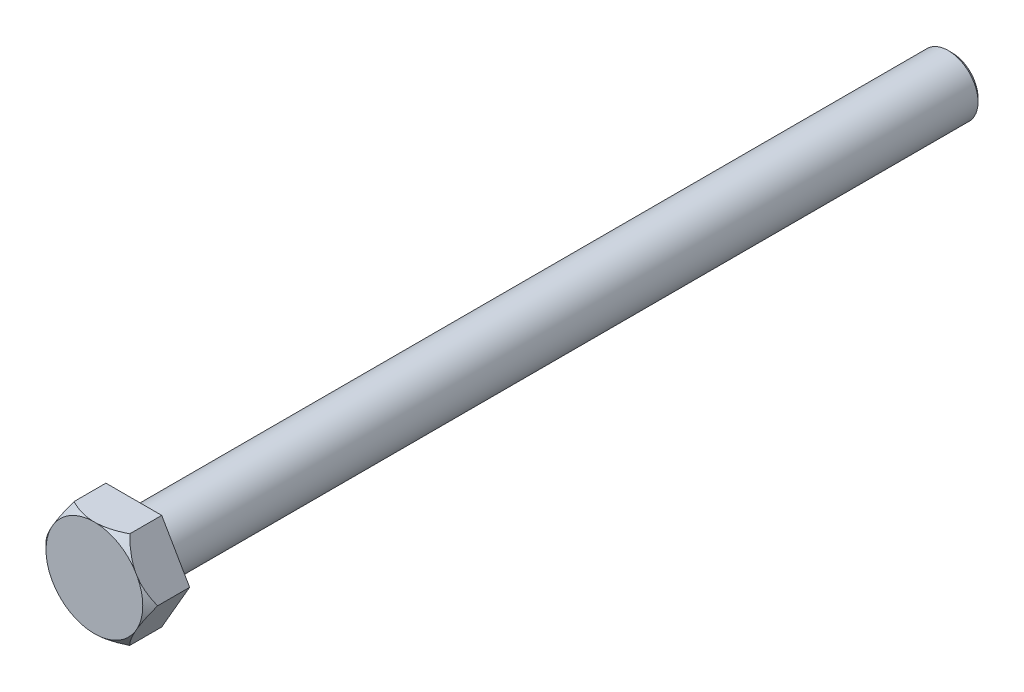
ISO-10303-21;
HEADER;
FILE_DESCRIPTION(('STEP AP214'),'2;1');
FILE_NAME('part.step','',(''),(''),'','','');
FILE_SCHEMA(('AUTOMOTIVE_DESIGN { 1 0 10303 214 1 1 1 1 }'));
ENDSEC;
DATA;
#1=APPLICATION_CONTEXT('core data for automotive mechanical design processes');
#2=APPLICATION_PROTOCOL_DEFINITION('international standard','automotive_design',2000,#1);
#3=PRODUCT_CONTEXT('',#1,'mechanical');
#4=PRODUCT('Part','Part','',(#3));
#5=PRODUCT_RELATED_PRODUCT_CATEGORY('part','',(#4));
#6=PRODUCT_DEFINITION_FORMATION('','',#4);
#7=PRODUCT_DEFINITION_CONTEXT('part definition',#1,'design');
#8=PRODUCT_DEFINITION('design','',#6,#7);
#9=PRODUCT_DEFINITION_SHAPE('','',#8);
#10=(LENGTH_UNIT() NAMED_UNIT(*) SI_UNIT(.MILLI.,.METRE.));
#11=(NAMED_UNIT(*) PLANE_ANGLE_UNIT() SI_UNIT($,.RADIAN.));
#12=(NAMED_UNIT(*) SI_UNIT($,.STERADIAN.) SOLID_ANGLE_UNIT());
#13=UNCERTAINTY_MEASURE_WITH_UNIT(LENGTH_MEASURE(1.E-05),#10,'distance_accuracy_value','');
#14=(GEOMETRIC_REPRESENTATION_CONTEXT(3) GLOBAL_UNCERTAINTY_ASSIGNED_CONTEXT((#13)) GLOBAL_UNIT_ASSIGNED_CONTEXT((#10,
#11,#12)) REPRESENTATION_CONTEXT('',''));
#15=CARTESIAN_POINT('',(0.,0.,0.));
#16=DIRECTION('',(0.,0.,1.));
#17=DIRECTION('',(1.,0.,0.));
#18=AXIS2_PLACEMENT_3D('',#15,#16,#17);
#19=CARTESIAN_POINT('',(0.,-4.,0.));
#20=DIRECTION('',(0.,0.,1.));
#21=DIRECTION('',(1.,0.,0.));
#22=AXIS2_PLACEMENT_3D('',#19,#20,#21);
#23=PLANE('',#22);
#24=CARTESIAN_POINT('',(0.,0.,0.));
#25=DIRECTION('',(0.,0.,1.));
#26=DIRECTION('',(1.,0.,0.));
#27=AXIS2_PLACEMENT_3D('',#24,#25,#26);
#28=CIRCLE('',#27,4.);
#29=CARTESIAN_POINT('',(4.,0.,0.));
#30=VERTEX_POINT('',#29);
#31=EDGE_CURVE('E11',#30,#30,#28,.T.);
#32=ORIENTED_EDGE('',*,*,#31,.T.);
#33=EDGE_LOOP('',(#32));
#34=FACE_BOUND('',#33,.T.);
#35=ADVANCED_FACE('F38',(#34),#23,.T.);
#36=CARTESIAN_POINT('',(0.,0.,0.));
#37=DIRECTION('',(0.,0.,1.));
#38=DIRECTION('',(1.,0.,0.));
#39=AXIS2_PLACEMENT_3D('',#36,#37,#38);
#40=CYLINDRICAL_SURFACE('',#39,4.);
#41=CARTESIAN_POINT('',(0.,0.,-109.5));
#42=DIRECTION('',(0.,0.,1.));
#43=DIRECTION('',(1.,0.,0.));
#44=AXIS2_PLACEMENT_3D('',#41,#42,#43);
#45=CIRCLE('',#44,4.);
#46=CARTESIAN_POINT('',(4.,0.,-109.5));
#47=VERTEX_POINT('',#46);
#48=EDGE_CURVE('E44',#47,#47,#45,.T.);
#49=ORIENTED_EDGE('',*,*,#48,.T.);
#50=EDGE_LOOP('',(#49));
#51=FACE_BOUND('',#50,.T.);
#52=ORIENTED_EDGE('',*,*,#31,.F.);
#53=EDGE_LOOP('',(#52));
#54=FACE_BOUND('',#53,.T.);
#55=ADVANCED_FACE('F64',(#51,#54),#40,.T.);
#56=CARTESIAN_POINT('',(0.,0.,-109.5));
#57=DIRECTION('',(0.,0.,1.));
#58=DIRECTION('',(1.,0.,0.));
#59=AXIS2_PLACEMENT_3D('',#56,#57,#58);
#60=CONICAL_SURFACE('',#59,4.,0.785398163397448);
#61=CARTESIAN_POINT('',(0.,0.,-110.));
#62=DIRECTION('',(0.,0.,1.));
#63=DIRECTION('',(1.,0.,0.));
#64=AXIS2_PLACEMENT_3D('',#61,#62,#63);
#65=CIRCLE('',#64,3.5);
#66=CARTESIAN_POINT('',(3.5,0.,-110.));
#67=VERTEX_POINT('',#66);
#68=EDGE_CURVE('E48',#67,#67,#65,.T.);
#69=ORIENTED_EDGE('',*,*,#68,.T.);
#70=EDGE_LOOP('',(#69));
#71=FACE_BOUND('',#70,.T.);
#72=ORIENTED_EDGE('',*,*,#48,.F.);
#73=EDGE_LOOP('',(#72));
#74=FACE_BOUND('',#73,.T.);
#75=ADVANCED_FACE('F55',(#71,#74),#60,.T.);
#76=CARTESIAN_POINT('',(0.,-3.5,-110.));
#77=DIRECTION('',(0.,0.,-1.));
#78=DIRECTION('',(-1.,0.,0.));
#79=AXIS2_PLACEMENT_3D('',#76,#77,#78);
#80=PLANE('',#79);
#81=ORIENTED_EDGE('',*,*,#68,.F.);
#82=EDGE_LOOP('',(#81));
#83=FACE_BOUND('',#82,.T.);
#84=ADVANCED_FACE('F58',(#83),#80,.T.);
#85=CLOSED_SHELL('',(#35,#55,#75,#84));
#86=MANIFOLD_SOLID_BREP('B2',#85);
#87=CARTESIAN_POINT('',(3.75277674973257,-6.5,5.3));
#88=DIRECTION('',(-0.866025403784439,0.5,0.));
#89=DIRECTION('',(-0.5,-0.866025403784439,0.));
#90=AXIS2_PLACEMENT_3D('',#87,#88,#89);
#91=PLANE('',#90);
#92=DIRECTION('',(0.,0.,-1.));
#93=VECTOR('',#92,1.);
#94=CARTESIAN_POINT('',(7.50555349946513,0.,5.3));
#95=LINE('',#94,#93);
#96=CARTESIAN_POINT('',(7.50555349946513,0.,4.3));
#97=VERTEX_POINT('',#96);
#98=CARTESIAN_POINT('',(7.50555349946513,0.,0.));
#99=VERTEX_POINT('',#98);
#100=EDGE_CURVE('E240',#97,#99,#95,.T.);
#101=ORIENTED_EDGE('',*,*,#100,.F.);
#102=CARTESIAN_POINT('',(10.1286443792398,4.54332667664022,0.704596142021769));
#103=CARTESIAN_POINT('',(10.039761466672,4.38937695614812,0.848684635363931));
#104=CARTESIAN_POINT('',(9.95052655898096,4.23481756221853,0.991912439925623));
#105=CARTESIAN_POINT('',(9.77123095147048,3.92426846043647,1.27631743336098));
#106=CARTESIAN_POINT('',(9.68117017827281,3.76827862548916,1.41749443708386));
#107=CARTESIAN_POINT('',(9.49990390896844,3.45431623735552,1.69777201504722));
#108=CARTESIAN_POINT('',(9.40869621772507,3.29633988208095,1.83686692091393));
#109=CARTESIAN_POINT('',(9.2252068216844,2.97852692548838,2.11218789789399));
#110=CARTESIAN_POINT('',(9.13292514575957,2.81869037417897,2.24841404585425));
#111=CARTESIAN_POINT('',(8.94456358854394,2.49243858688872,2.52115169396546));
#112=CARTESIAN_POINT('',(8.84844908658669,2.32596338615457,2.65756778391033));
#113=CARTESIAN_POINT('',(8.65470525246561,1.99038922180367,2.92602381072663));
#114=CARTESIAN_POINT('',(8.5570759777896,1.82129035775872,3.0580639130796));
#115=CARTESIAN_POINT('',(8.36013893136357,1.48018538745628,3.31668899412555));
#116=CARTESIAN_POINT('',(8.26083264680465,1.30818185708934,3.44327848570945));
#117=CARTESIAN_POINT('',(8.0601982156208,0.960672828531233,3.68985078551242));
#118=CARTESIAN_POINT('',(7.95887032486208,0.78516777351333,3.80983442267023));
#119=CARTESIAN_POINT('',(7.75111491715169,0.425324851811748,4.04472132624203));
#120=CARTESIAN_POINT('',(7.64462356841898,0.24087642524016,4.15940026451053));
#121=CARTESIAN_POINT('',(7.42883796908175,-0.132875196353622,4.37785828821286));
#122=CARTESIAN_POINT('',(7.31954332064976,-0.3221790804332,4.48163581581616));
#123=CARTESIAN_POINT('',(7.09850568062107,-0.705027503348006,4.67487713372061));
#124=CARTESIAN_POINT('',(6.98677906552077,-0.898543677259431,4.7644150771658));
#125=CARTESIAN_POINT('',(6.76025349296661,-1.29089747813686,4.92639894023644));
#126=CARTESIAN_POINT('',(6.64545547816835,-1.48973347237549,4.99885003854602));
#127=CARTESIAN_POINT('',(6.43587432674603,-1.85273867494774,5.11072478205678));
#128=CARTESIAN_POINT('',(6.34158660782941,-2.01604979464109,5.15384004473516));
#129=CARTESIAN_POINT('',(6.15157362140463,-2.34516194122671,5.22476075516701));
#130=CARTESIAN_POINT('',(6.0558485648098,-2.51096260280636,5.25256842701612));
#131=CARTESIAN_POINT('',(5.8637126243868,-2.84375181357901,5.29144611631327));
#132=CARTESIAN_POINT('',(5.76730326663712,-3.01073771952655,5.30254587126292));
#133=CARTESIAN_POINT('',(5.5743709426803,-3.34490630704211,5.30749252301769));
#134=CARTESIAN_POINT('',(5.47784797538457,-3.51208899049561,5.30133925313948));
#135=CARTESIAN_POINT('',(5.28569658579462,-3.84490496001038,5.27215863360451));
#136=CARTESIAN_POINT('',(5.19006652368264,-4.01054108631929,5.24917378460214));
#137=CARTESIAN_POINT('',(5.00008490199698,-4.33959890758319,5.18756324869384));
#138=CARTESIAN_POINT('',(4.90573344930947,-4.50302041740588,5.14893626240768));
#139=CARTESIAN_POINT('',(4.71846263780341,-4.82738297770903,5.05763503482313));
#140=CARTESIAN_POINT('',(4.6255484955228,-4.98831499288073,5.00491850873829));
#141=CARTESIAN_POINT('',(4.44167070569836,-5.30680066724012,4.88744691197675));
#142=CARTESIAN_POINT('',(4.35070696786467,-5.46435448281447,4.82269239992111));
#143=CARTESIAN_POINT('',(4.13900239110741,-5.83103756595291,4.65838995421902));
#144=CARTESIAN_POINT('',(4.01908237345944,-6.03874512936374,4.55462806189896));
#145=CARTESIAN_POINT('',(3.78262258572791,-6.4483054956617,4.33258564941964));
#146=CARTESIAN_POINT('',(3.66608473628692,-6.65015497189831,4.21429707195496));
#147=CARTESIAN_POINT('',(3.43582542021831,-7.0489758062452,3.96621331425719));
#148=CARTESIAN_POINT('',(3.3221102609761,-7.2459362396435,3.83639489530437));
#149=CARTESIAN_POINT('',(3.09735084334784,-7.63523097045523,3.56796602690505));
#150=CARTESIAN_POINT('',(2.98630610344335,-7.82756610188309,3.4293571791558));
#151=CARTESIAN_POINT('',(2.76596059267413,-8.20921572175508,3.14452754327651));
#152=CARTESIAN_POINT('',(2.65667036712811,-8.39851194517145,2.99827427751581));
#153=CARTESIAN_POINT('',(2.44001623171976,-8.77376791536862,2.70017211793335));
#154=CARTESIAN_POINT('',(2.33265239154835,-8.95972754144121,2.54832302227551));
#155=CARTESIAN_POINT('',(2.11967159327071,-9.32862110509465,2.24027391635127));
#156=CARTESIAN_POINT('',(2.01405293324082,-9.51155799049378,2.08407859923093));
#157=CARTESIAN_POINT('',(1.80420589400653,-9.87502372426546,1.76801397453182));
#158=CARTESIAN_POINT('',(1.69997748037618,-10.0555526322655,1.60814475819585));
#159=CARTESIAN_POINT('',(1.51776278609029,-10.3711577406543,1.32438976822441));
#160=CARTESIAN_POINT('',(1.43952456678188,-10.5066703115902,1.20114938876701));
#161=CARTESIAN_POINT('',(1.28399947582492,-10.7760476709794,0.953684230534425));
#162=CARTESIAN_POINT('',(1.20670993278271,-10.9099170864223,0.829466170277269));
#163=CARTESIAN_POINT('',(1.12968586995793,-11.0433266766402,0.704596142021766));
#164=B_SPLINE_CURVE_WITH_KNOTS('',3,(#102,#103,#104,#105,#106,#107,#108,#109,#110,#111,#112,
#113,#114,#115,#116,#117,#118,#119,#120,#121,#122,#123,#124,#125,#126,#127,#128,#129,#130,#131,
#132,#133,#134,#135,#136,#137,#138,#139,#140,#141,#142,#143,#144,#145,#146,#147,#148,#149,#150,
#151,#152,#153,#154,#155,#156,#157,#158,#159,#160,#161,#162,#163),.UNSPECIFIED.,.F.,.F.,(4,2,2,
2,2,2,2,2,2,2,2,2,2,2,2,2,2,2,2,2,2,2,2,2,2,2,2,2,2,2,4),(0.,0.686488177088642,1.3730379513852,
2.06120340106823,2.749350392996,3.4564439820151,4.16351080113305,4.8699804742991,
5.57636129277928,6.30179544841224,7.02733312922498,7.74895922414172,8.47036632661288,
9.05013970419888,9.62982882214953,10.2084849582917,10.7871466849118,11.3643522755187,
11.941605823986,12.52061163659,13.0995905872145,13.8829026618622,14.6666511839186,
15.4520168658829,16.2372398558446,17.0261239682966,17.8150365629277,18.6031280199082,
19.3911999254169,19.9887336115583,20.5836377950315),.UNSPECIFIED.);
#165=CARTESIAN_POINT('',(5.76353991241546,-3.01725604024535,5.3));
#166=VERTEX_POINT('',#165);
#167=EDGE_CURVE('E218',#97,#166,#164,.T.);
#168=ORIENTED_EDGE('',*,*,#167,.T.);
#169=DIRECTION('',(0.5,0.866025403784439,0.));
#170=VECTOR('',#169,1.);
#171=CARTESIAN_POINT('',(3.75277674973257,-6.5,5.3));
#172=LINE('',#171,#170);
#173=CARTESIAN_POINT('',(5.49479033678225,-3.48274395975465,5.3));
#174=VERTEX_POINT('',#173);
#175=EDGE_CURVE('E232',#174,#166,#172,.T.);
#176=ORIENTED_EDGE('',*,*,#175,.F.);
#177=CARTESIAN_POINT('',(3.75277674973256,-6.5,4.3));
#178=VERTEX_POINT('',#177);
#179=EDGE_CURVE('E305',#174,#178,#164,.T.);
#180=ORIENTED_EDGE('',*,*,#179,.T.);
#181=DIRECTION('',(0.,0.,-1.));
#182=VECTOR('',#181,1.);
#183=CARTESIAN_POINT('',(3.75277674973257,-6.5,5.3));
#184=LINE('',#183,#182);
#185=CARTESIAN_POINT('',(3.75277674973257,-6.5,0.));
#186=VERTEX_POINT('',#185);
#187=EDGE_CURVE('E213',#178,#186,#184,.T.);
#188=ORIENTED_EDGE('',*,*,#187,.T.);
#189=DIRECTION('',(0.5,0.866025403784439,0.));
#190=VECTOR('',#189,1.);
#191=CARTESIAN_POINT('',(3.75277674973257,-6.5,0.));
#192=LINE('',#191,#190);
#193=EDGE_CURVE('E214',#186,#99,#192,.T.);
#194=ORIENTED_EDGE('',*,*,#193,.T.);
#195=EDGE_LOOP('',(#101,#168,#176,#180,#188,#194));
#196=FACE_BOUND('',#195,.T.);
#197=ADVANCED_FACE('F93',(#196),#91,.F.);
#198=CARTESIAN_POINT('',(7.50555349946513,0.,5.3));
#199=DIRECTION('',(-0.866025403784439,-0.5,0.));
#200=DIRECTION('',(0.5,-0.866025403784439,0.));
#201=AXIS2_PLACEMENT_3D('',#198,#199,#200);
#202=PLANE('',#201);
#203=DIRECTION('',(0.,0.,-1.));
#204=VECTOR('',#203,1.);
#205=CARTESIAN_POINT('',(3.75277674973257,6.5,5.3));
#206=LINE('',#205,#204);
#207=CARTESIAN_POINT('',(3.75277674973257,6.5,4.3));
#208=VERTEX_POINT('',#207);
#209=CARTESIAN_POINT('',(3.75277674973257,6.5,0.));
#210=VERTEX_POINT('',#209);
#211=EDGE_CURVE('E239',#208,#210,#206,.T.);
#212=ORIENTED_EDGE('',*,*,#211,.F.);
#213=CARTESIAN_POINT('',(1.12968586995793,11.0433266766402,0.704596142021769));
#214=CARTESIAN_POINT('',(1.21856878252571,10.8893769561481,0.848684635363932));
#215=CARTESIAN_POINT('',(1.30780369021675,10.7348175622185,0.991912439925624));
#216=CARTESIAN_POINT('',(1.48709929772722,10.4242684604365,1.27631743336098));
#217=CARTESIAN_POINT('',(1.57716007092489,10.2682786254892,1.41749443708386));
#218=CARTESIAN_POINT('',(1.75842634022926,9.95431623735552,1.69777201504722));
#219=CARTESIAN_POINT('',(1.84963403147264,9.79633988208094,1.83686692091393));
#220=CARTESIAN_POINT('',(2.0331234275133,9.47852692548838,2.11218789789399));
#221=CARTESIAN_POINT('',(2.12540510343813,9.31869037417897,2.24841404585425));
#222=CARTESIAN_POINT('',(2.31376666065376,8.99243858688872,2.52115169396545));
#223=CARTESIAN_POINT('',(2.40988116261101,8.82596338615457,2.65756778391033));
#224=CARTESIAN_POINT('',(2.60362499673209,8.49038922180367,2.92602381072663));
#225=CARTESIAN_POINT('',(2.7012542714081,8.32129035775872,3.05806391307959));
#226=CARTESIAN_POINT('',(2.89819131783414,7.98018538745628,3.31668899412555));
#227=CARTESIAN_POINT('',(2.99749760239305,7.80818185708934,3.44327848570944));
#228=CARTESIAN_POINT('',(3.1981320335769,7.46067282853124,3.68985078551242));
#229=CARTESIAN_POINT('',(3.29945992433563,7.28516777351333,3.80983442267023));
#230=CARTESIAN_POINT('',(3.50721533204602,6.92532485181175,4.04472132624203));
#231=CARTESIAN_POINT('',(3.61370668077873,6.74087642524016,4.15940026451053));
#232=CARTESIAN_POINT('',(3.82949228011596,6.36712480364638,4.37785828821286));
#233=CARTESIAN_POINT('',(3.93878692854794,6.1778209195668,4.48163581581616));
#234=CARTESIAN_POINT('',(4.15982456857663,5.794972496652,4.67487713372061));
#235=CARTESIAN_POINT('',(4.27155118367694,5.60145632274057,4.7644150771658));
#236=CARTESIAN_POINT('',(4.49807675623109,5.20910252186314,4.92639894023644));
#237=CARTESIAN_POINT('',(4.61287477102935,5.01026652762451,4.99885003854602));
#238=CARTESIAN_POINT('',(4.82245592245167,4.64726132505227,5.11072478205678));
#239=CARTESIAN_POINT('',(4.91674364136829,4.48395020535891,5.15384004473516));
#240=CARTESIAN_POINT('',(5.10675662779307,4.15483805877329,5.22476075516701));
#241=CARTESIAN_POINT('',(5.20248168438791,3.98903739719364,5.25256842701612));
#242=CARTESIAN_POINT('',(5.3946176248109,3.65624818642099,5.29144611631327));
#243=CARTESIAN_POINT('',(5.49102698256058,3.48926228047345,5.30254587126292));
#244=CARTESIAN_POINT('',(5.6839593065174,3.15509369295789,5.30749252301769));
#245=CARTESIAN_POINT('',(5.78048227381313,2.98791100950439,5.30133925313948));
#246=CARTESIAN_POINT('',(5.97263366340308,2.65509503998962,5.27215863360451));
#247=CARTESIAN_POINT('',(6.06826372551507,2.48945891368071,5.24917378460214));
#248=CARTESIAN_POINT('',(6.25824534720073,2.16040109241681,5.18756324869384));
#249=CARTESIAN_POINT('',(6.35259679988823,1.99697958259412,5.14893626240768));
#250=CARTESIAN_POINT('',(6.5398676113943,1.67261702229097,5.05763503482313));
#251=CARTESIAN_POINT('',(6.6327817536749,1.51168500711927,5.00491850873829));
#252=CARTESIAN_POINT('',(6.81665954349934,1.19319933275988,4.88744691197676));
#253=CARTESIAN_POINT('',(6.90762328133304,1.03564551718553,4.82269239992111));
#254=CARTESIAN_POINT('',(7.1193278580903,0.668962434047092,4.65838995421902));
#255=CARTESIAN_POINT('',(7.23924787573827,0.461254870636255,4.55462806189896));
#256=CARTESIAN_POINT('',(7.4757076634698,0.0516945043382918,4.33258564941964));
#257=CARTESIAN_POINT('',(7.59224551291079,-0.150154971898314,4.21429707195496));
#258=CARTESIAN_POINT('',(7.82250482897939,-0.548975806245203,3.96621331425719));
#259=CARTESIAN_POINT('',(7.93621998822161,-0.7459362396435,3.83639489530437));
#260=CARTESIAN_POINT('',(8.16097940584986,-1.13523097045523,3.56796602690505));
#261=CARTESIAN_POINT('',(8.27202414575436,-1.32756610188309,3.4293571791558));
#262=CARTESIAN_POINT('',(8.49236965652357,-1.70921572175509,3.14452754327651));
#263=CARTESIAN_POINT('',(8.6016598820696,-1.89851194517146,2.99827427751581));
#264=CARTESIAN_POINT('',(8.81831401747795,-2.27376791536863,2.70017211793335));
#265=CARTESIAN_POINT('',(8.92567785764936,-2.45972754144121,2.5483230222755));
#266=CARTESIAN_POINT('',(9.138658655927,-2.82862110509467,2.24027391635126));
#267=CARTESIAN_POINT('',(9.24427731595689,-3.01155799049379,2.08407859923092));
#268=CARTESIAN_POINT('',(9.45412435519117,-3.37502372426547,1.76801397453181));
#269=CARTESIAN_POINT('',(9.55835276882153,-3.55555263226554,1.60814475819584));
#270=CARTESIAN_POINT('',(9.74056746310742,-3.87115774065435,1.3243897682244));
#271=CARTESIAN_POINT('',(9.81880568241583,-4.00667031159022,1.20114938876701));
#272=CARTESIAN_POINT('',(9.97433077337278,-4.27604767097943,0.953684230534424));
#273=CARTESIAN_POINT('',(10.051620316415,-4.40991708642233,0.829466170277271));
#274=CARTESIAN_POINT('',(10.1286443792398,-4.54332667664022,0.704596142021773));
#275=B_SPLINE_CURVE_WITH_KNOTS('',3,(#213,#214,#215,#216,#217,#218,#219,#220,#221,#222,#223,
#224,#225,#226,#227,#228,#229,#230,#231,#232,#233,#234,#235,#236,#237,#238,#239,#240,#241,#242,
#243,#244,#245,#246,#247,#248,#249,#250,#251,#252,#253,#254,#255,#256,#257,#258,#259,#260,#261,
#262,#263,#264,#265,#266,#267,#268,#269,#270,#271,#272,#273,#274),.UNSPECIFIED.,.F.,.F.,(4,2,2,
2,2,2,2,2,2,2,2,2,2,2,2,2,2,2,2,2,2,2,2,2,2,2,2,2,2,2,4),(0.,0.686488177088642,1.37303795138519,
2.06120340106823,2.749350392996,3.4564439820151,4.16351080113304,4.86998047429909,
5.57636129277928,6.30179544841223,7.02733312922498,7.74895922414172,8.47036632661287,
9.05013970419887,9.62982882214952,10.2084849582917,10.7871466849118,11.3643522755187,
11.941605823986,12.52061163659,13.0995905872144,13.8829026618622,14.6666511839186,
15.4520168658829,16.2372398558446,17.0261239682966,17.8150365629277,18.6031280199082,
19.391199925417,19.9887336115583,20.5836377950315),.UNSPECIFIED.);
#276=CARTESIAN_POINT('',(5.49479033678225,3.48274395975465,5.3));
#277=VERTEX_POINT('',#276);
#278=EDGE_CURVE('E268',#208,#277,#275,.T.);
#279=ORIENTED_EDGE('',*,*,#278,.T.);
#280=DIRECTION('',(-0.5,0.866025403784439,0.));
#281=VECTOR('',#280,1.);
#282=CARTESIAN_POINT('',(7.50555349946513,0.,5.3));
#283=LINE('',#282,#281);
#284=CARTESIAN_POINT('',(5.76353991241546,3.01725604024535,5.3));
#285=VERTEX_POINT('',#284);
#286=EDGE_CURVE('E207',#285,#277,#283,.T.);
#287=ORIENTED_EDGE('',*,*,#286,.F.);
#288=EDGE_CURVE('E273',#285,#97,#275,.T.);
#289=ORIENTED_EDGE('',*,*,#288,.T.);
#290=ORIENTED_EDGE('',*,*,#100,.T.);
#291=DIRECTION('',(-0.5,0.866025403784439,0.));
#292=VECTOR('',#291,1.);
#293=CARTESIAN_POINT('',(7.50555349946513,0.,0.));
#294=LINE('',#293,#292);
#295=EDGE_CURVE('E217',#99,#210,#294,.T.);
#296=ORIENTED_EDGE('',*,*,#295,.T.);
#297=EDGE_LOOP('',(#212,#279,#287,#289,#290,#296));
#298=FACE_BOUND('',#297,.T.);
#299=ADVANCED_FACE('F278',(#298),#202,.F.);
#300=CARTESIAN_POINT('',(3.75277674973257,6.5,5.3));
#301=DIRECTION('',(0.,-1.,0.));
#302=DIRECTION('',(1.,0.,0.));
#303=AXIS2_PLACEMENT_3D('',#300,#301,#302);
#304=PLANE('',#303);
#305=DIRECTION('',(0.,0.,-1.));
#306=VECTOR('',#305,1.);
#307=CARTESIAN_POINT('',(-3.75277674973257,6.5,5.3));
#308=LINE('',#307,#306);
#309=CARTESIAN_POINT('',(-3.75277674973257,6.5,4.3));
#310=VERTEX_POINT('',#309);
#311=CARTESIAN_POINT('',(-3.75277674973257,6.5,0.));
#312=VERTEX_POINT('',#311);
#313=EDGE_CURVE('E237',#310,#312,#308,.T.);
#314=ORIENTED_EDGE('',*,*,#313,.F.);
#315=CARTESIAN_POINT('',(-8.29610342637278,6.5,1.26632525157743));
#316=CARTESIAN_POINT('',(-8.11036530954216,6.5,1.41250581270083));
#317=CARTESIAN_POINT('',(-7.92373684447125,6.5,1.55756954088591));
#318=CARTESIAN_POINT('',(-7.54835509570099,6.5,1.84498409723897));
#319=CARTESIAN_POINT('',(-7.35960146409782,6.5,1.98733447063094));
#320=CARTESIAN_POINT('',(-6.97873252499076,6.5,2.2695011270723));
#321=CARTESIAN_POINT('',(-6.7866050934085,6.5,2.40930108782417));
#322=CARTESIAN_POINT('',(-6.39953728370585,6.5,2.68493925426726));
#323=CARTESIAN_POINT('',(-6.20459704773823,6.5,2.82077765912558));
#324=CARTESIAN_POINT('',(-5.80175036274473,6.5,3.09421885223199));
#325=CARTESIAN_POINT('',(-5.59367836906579,6.5,3.231578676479));
#326=CARTESIAN_POINT('',(-5.17329124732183,6.5,3.49972871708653));
#327=CARTESIAN_POINT('',(-4.96097565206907,6.5,3.63051820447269));
#328=CARTESIAN_POINT('',(-4.53185755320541,6.5,3.88357409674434));
#329=CARTESIAN_POINT('',(-4.31506466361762,6.5,4.00585671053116));
#330=CARTESIAN_POINT('',(-3.87593140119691,6.5,4.23995118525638));
#331=CARTESIAN_POINT('',(-3.65359273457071,6.5,4.35176621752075));
#332=CARTESIAN_POINT('',(-3.22593082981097,6.5,4.55126761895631));
#333=CARTESIAN_POINT('',(-3.02121813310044,6.5,4.64025315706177));
#334=CARTESIAN_POINT('',(-2.60646306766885,6.5,4.80502186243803));
#335=CARTESIAN_POINT('',(-2.39642019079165,6.5,4.88080376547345));
#336=CARTESIAN_POINT('',(-1.97356357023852,6.5,5.01546630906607));
#337=CARTESIAN_POINT('',(-1.76080909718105,6.5,5.07453054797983));
#338=CARTESIAN_POINT('',(-1.33093571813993,6.5,5.17398366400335));
#339=CARTESIAN_POINT('',(-1.11381737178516,6.5,5.21437492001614));
#340=CARTESIAN_POINT('',(-0.672554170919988,6.5,5.27457108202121));
#341=CARTESIAN_POINT('',(-0.448353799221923,6.5,5.29397782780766));
#342=CARTESIAN_POINT('',(0.000845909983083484,6.5,5.30942901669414));
#343=CARTESIAN_POINT('',(0.225845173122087,6.5,5.30547558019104));
#344=CARTESIAN_POINT('',(0.67488777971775,6.5,5.27446419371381));
#345=CARTESIAN_POINT('',(0.898926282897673,6.5,5.24733749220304));
#346=CARTESIAN_POINT('',(1.34336613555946,6.5,5.17180698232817));
#347=CARTESIAN_POINT('',(1.56376649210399,6.5,5.12339746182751));
#348=CARTESIAN_POINT('',(2.06628953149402,6.5,4.99055568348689));
#349=CARTESIAN_POINT('',(2.34668289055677,6.5,4.89963518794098));
#350=CARTESIAN_POINT('',(2.89824997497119,6.5,4.69329359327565));
#351=CARTESIAN_POINT('',(3.16941809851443,6.5,4.57785790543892));
#352=CARTESIAN_POINT('',(3.70495151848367,6.5,4.32757146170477));
#353=CARTESIAN_POINT('',(3.96925216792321,6.5,4.19258424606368));
#354=CARTESIAN_POINT('',(4.49001736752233,6.5,3.90855044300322));
#355=CARTESIAN_POINT('',(4.74648371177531,6.5,3.75950710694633));
#356=CARTESIAN_POINT('',(5.2907154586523,6.5,3.42770091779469));
#357=CARTESIAN_POINT('',(5.57743102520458,6.5,3.24322742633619));
#358=CARTESIAN_POINT('',(6.14392762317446,6.5,2.86387292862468));
#359=CARTESIAN_POINT('',(6.42370706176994,6.5,2.66898956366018));
#360=CARTESIAN_POINT('',(6.97140928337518,6.5,2.27586119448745));
#361=CARTESIAN_POINT('',(7.23945723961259,6.5,2.07778986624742));
#362=CARTESIAN_POINT('',(7.63813759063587,6.5,1.77641508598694));
#363=CARTESIAN_POINT('',(7.77042024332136,6.5,1.67528153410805));
#364=CARTESIAN_POINT('',(8.0339850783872,6.5,1.47172940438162));
#365=CARTESIAN_POINT('',(8.16526730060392,6.5,1.36931087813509));
#366=CARTESIAN_POINT('',(8.29610342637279,6.5,1.26632525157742));
#367=B_SPLINE_CURVE_WITH_KNOTS('',3,(#315,#316,#317,#318,#319,#320,#321,#322,#323,#324,#325,
#326,#327,#328,#329,#330,#331,#332,#333,#334,#335,#336,#337,#338,#339,#340,#341,#342,#343,#344,
#345,#346,#347,#348,#349,#350,#351,#352,#353,#354,#355,#356,#357,#358,#359,#360,#361,#362,#363,
#364,#365,#366),.UNSPECIFIED.,.F.,.F.,(4,2,2,2,2,2,2,2,2,2,2,2,2,2,2,2,2,2,2,2,2,2,2,2,2,4),(0.,
0.709097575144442,1.41831297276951,2.13109111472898,2.84383335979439,3.59170118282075,
4.3396517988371,5.0861358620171,5.83239302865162,6.5016733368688,7.17101769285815,
7.83269743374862,8.49429285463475,9.16823229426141,9.84211056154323,10.5179950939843,
11.1940611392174,12.0768086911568,12.9600830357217,13.8498492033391,14.7394100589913,
15.7619006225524,16.7846238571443,17.7843881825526,18.2839221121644,18.7834360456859),.UNSPECIFIED.);
#368=CARTESIAN_POINT('',(-0.26874957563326,6.5,5.3));
#369=VERTEX_POINT('',#368);
#370=EDGE_CURVE('E255',#310,#369,#367,.T.);
#371=ORIENTED_EDGE('',*,*,#370,.T.);
#372=DIRECTION('',(-1.,0.,0.));
#373=VECTOR('',#372,1.);
#374=CARTESIAN_POINT('',(3.75277674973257,6.5,5.3));
#375=LINE('',#374,#373);
#376=CARTESIAN_POINT('',(0.268749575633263,6.5,5.3));
#377=VERTEX_POINT('',#376);
#378=EDGE_CURVE('E203',#377,#369,#375,.T.);
#379=ORIENTED_EDGE('',*,*,#378,.F.);
#380=EDGE_CURVE('E261',#377,#208,#367,.T.);
#381=ORIENTED_EDGE('',*,*,#380,.T.);
#382=ORIENTED_EDGE('',*,*,#211,.T.);
#383=DIRECTION('',(-1.,0.,0.));
#384=VECTOR('',#383,1.);
#385=CARTESIAN_POINT('',(3.75277674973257,6.5,0.));
#386=LINE('',#385,#384);
#387=EDGE_CURVE('E221',#210,#312,#386,.T.);
#388=ORIENTED_EDGE('',*,*,#387,.T.);
#389=EDGE_LOOP('',(#314,#371,#379,#381,#382,#388));
#390=FACE_BOUND('',#389,.T.);
#391=ADVANCED_FACE('F259',(#390),#304,.F.);
#392=CARTESIAN_POINT('',(-3.75277674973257,6.5,5.3));
#393=DIRECTION('',(0.866025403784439,-0.5,0.));
#394=DIRECTION('',(0.5,0.866025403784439,0.));
#395=AXIS2_PLACEMENT_3D('',#392,#393,#394);
#396=PLANE('',#395);
#397=DIRECTION('',(0.,0.,-1.));
#398=VECTOR('',#397,1.);
#399=CARTESIAN_POINT('',(-7.50555349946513,0.,5.3));
#400=LINE('',#399,#398);
#401=CARTESIAN_POINT('',(-7.50555349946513,0.,4.3));
#402=VERTEX_POINT('',#401);
#403=CARTESIAN_POINT('',(-7.50555349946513,0.,0.));
#404=VERTEX_POINT('',#403);
#405=EDGE_CURVE('E195',#402,#404,#400,.T.);
#406=ORIENTED_EDGE('',*,*,#405,.F.);
#407=CARTESIAN_POINT('',(-10.1286443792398,-4.54332667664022,0.704596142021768));
#408=CARTESIAN_POINT('',(-10.039761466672,-4.38937695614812,0.84868463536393));
#409=CARTESIAN_POINT('',(-9.95052655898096,-4.23481756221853,0.991912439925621));
#410=CARTESIAN_POINT('',(-9.77123095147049,-3.92426846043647,1.27631743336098));
#411=CARTESIAN_POINT('',(-9.68117017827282,-3.76827862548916,1.41749443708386));
#412=CARTESIAN_POINT('',(-9.49990390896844,-3.45431623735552,1.69777201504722));
#413=CARTESIAN_POINT('',(-9.40869621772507,-3.29633988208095,1.83686692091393));
#414=CARTESIAN_POINT('',(-9.2252068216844,-2.97852692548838,2.11218789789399));
#415=CARTESIAN_POINT('',(-9.13292514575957,-2.81869037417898,2.24841404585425));
#416=CARTESIAN_POINT('',(-8.94456358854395,-2.49243858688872,2.52115169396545));
#417=CARTESIAN_POINT('',(-8.84844908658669,-2.32596338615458,2.65756778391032));
#418=CARTESIAN_POINT('',(-8.65470525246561,-1.99038922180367,2.92602381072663));
#419=CARTESIAN_POINT('',(-8.55707597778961,-1.82129035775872,3.05806391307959));
#420=CARTESIAN_POINT('',(-8.36013893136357,-1.48018538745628,3.31668899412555));
#421=CARTESIAN_POINT('',(-8.26083264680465,-1.30818185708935,3.44327848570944));
#422=CARTESIAN_POINT('',(-8.0601982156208,-0.96067282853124,3.68985078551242));
#423=CARTESIAN_POINT('',(-7.95887032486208,-0.785167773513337,3.80983442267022));
#424=CARTESIAN_POINT('',(-7.75111491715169,-0.425324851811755,4.04472132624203));
#425=CARTESIAN_POINT('',(-7.64462356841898,-0.240876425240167,4.15940026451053));
#426=CARTESIAN_POINT('',(-7.42883796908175,0.132875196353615,4.37785828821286));
#427=CARTESIAN_POINT('',(-7.31954332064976,0.322179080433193,4.48163581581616));
#428=CARTESIAN_POINT('',(-7.09850568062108,0.705027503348,4.67487713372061));
#429=CARTESIAN_POINT('',(-6.98677906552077,0.898543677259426,4.7644150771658));
#430=CARTESIAN_POINT('',(-6.76025349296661,1.29089747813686,4.92639894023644));
#431=CARTESIAN_POINT('',(-6.64545547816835,1.48973347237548,4.99885003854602));
#432=CARTESIAN_POINT('',(-6.43587432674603,1.85273867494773,5.11072478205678));
#433=CARTESIAN_POINT('',(-6.34158660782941,2.01604979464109,5.15384004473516));
#434=CARTESIAN_POINT('',(-6.15157362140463,2.3451619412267,5.22476075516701));
#435=CARTESIAN_POINT('',(-6.0558485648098,2.51096260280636,5.25256842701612));
#436=CARTESIAN_POINT('',(-5.86371262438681,2.84375181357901,5.29144611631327));
#437=CARTESIAN_POINT('',(-5.76730326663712,3.01073771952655,5.30254587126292));
#438=CARTESIAN_POINT('',(-5.5743709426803,3.3449063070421,5.30749252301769));
#439=CARTESIAN_POINT('',(-5.47784797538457,3.51208899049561,5.30133925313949));
#440=CARTESIAN_POINT('',(-5.28569658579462,3.84490496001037,5.27215863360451));
#441=CARTESIAN_POINT('',(-5.19006652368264,4.01054108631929,5.24917378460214));
#442=CARTESIAN_POINT('',(-5.00008490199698,4.33959890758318,5.18756324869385));
#443=CARTESIAN_POINT('',(-4.90573344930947,4.50302041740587,5.14893626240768));
#444=CARTESIAN_POINT('',(-4.71846263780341,4.82738297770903,5.05763503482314));
#445=CARTESIAN_POINT('',(-4.6255484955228,4.98831499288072,5.00491850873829));
#446=CARTESIAN_POINT('',(-4.44167070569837,5.30680066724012,4.88744691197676));
#447=CARTESIAN_POINT('',(-4.35070696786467,5.46435448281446,4.82269239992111));
#448=CARTESIAN_POINT('',(-4.13900239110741,5.8310375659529,4.65838995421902));
#449=CARTESIAN_POINT('',(-4.01908237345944,6.03874512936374,4.55462806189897));
#450=CARTESIAN_POINT('',(-3.78262258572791,6.4483054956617,4.33258564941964));
#451=CARTESIAN_POINT('',(-3.66608473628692,6.6501549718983,4.21429707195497));
#452=CARTESIAN_POINT('',(-3.43582542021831,7.04897580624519,3.9662133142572));
#453=CARTESIAN_POINT('',(-3.3221102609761,7.24593623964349,3.83639489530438));
#454=CARTESIAN_POINT('',(-3.09735084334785,7.63523097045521,3.56796602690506));
#455=CARTESIAN_POINT('',(-2.98630610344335,7.82756610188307,3.42935717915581));
#456=CARTESIAN_POINT('',(-2.76596059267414,8.20921572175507,3.14452754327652));
#457=CARTESIAN_POINT('',(-2.65667036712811,8.39851194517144,2.99827427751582));
#458=CARTESIAN_POINT('',(-2.44001623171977,8.77376791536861,2.70017211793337));
#459=CARTESIAN_POINT('',(-2.33265239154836,8.95972754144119,2.54832302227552));
#460=CARTESIAN_POINT('',(-2.11967159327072,9.32862110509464,2.24027391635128));
#461=CARTESIAN_POINT('',(-2.01405293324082,9.51155799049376,2.08407859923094));
#462=CARTESIAN_POINT('',(-1.80420589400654,9.87502372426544,1.76801397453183));
#463=CARTESIAN_POINT('',(-1.69997748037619,10.0555526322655,1.60814475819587));
#464=CARTESIAN_POINT('',(-1.51776278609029,10.3711577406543,1.32438976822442));
#465=CARTESIAN_POINT('',(-1.43952456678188,10.5066703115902,1.20114938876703));
#466=CARTESIAN_POINT('',(-1.28399947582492,10.7760476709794,0.953684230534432));
#467=CARTESIAN_POINT('',(-1.20670993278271,10.9099170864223,0.829466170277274));
#468=CARTESIAN_POINT('',(-1.12968586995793,11.0433266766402,0.704596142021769));
#469=B_SPLINE_CURVE_WITH_KNOTS('',3,(#407,#408,#409,#410,#411,#412,#413,#414,#415,#416,#417,
#418,#419,#420,#421,#422,#423,#424,#425,#426,#427,#428,#429,#430,#431,#432,#433,#434,#435,#436,
#437,#438,#439,#440,#441,#442,#443,#444,#445,#446,#447,#448,#449,#450,#451,#452,#453,#454,#455,
#456,#457,#458,#459,#460,#461,#462,#463,#464,#465,#466,#467,#468),.UNSPECIFIED.,.F.,.F.,(4,2,2,
2,2,2,2,2,2,2,2,2,2,2,2,2,2,2,2,2,2,2,2,2,2,2,2,2,2,2,4),(0.,0.686488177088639,1.37303795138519,
2.06120340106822,2.749350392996,3.45644398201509,4.16351080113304,4.86998047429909,
5.57636129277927,6.30179544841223,7.02733312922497,7.74895922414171,8.47036632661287,
9.05013970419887,9.62982882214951,10.2084849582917,10.7871466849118,11.3643522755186,
11.9416058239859,12.52061163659,13.0995905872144,13.8829026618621,14.6666511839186,
15.4520168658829,16.2372398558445,17.0261239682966,17.8150365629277,18.6031280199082,
19.3911999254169,19.9887336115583,20.5836377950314),.UNSPECIFIED.);
#470=CARTESIAN_POINT('',(-5.76353991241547,3.01725604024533,5.3));
#471=VERTEX_POINT('',#470);
#472=EDGE_CURVE('E182',#402,#471,#469,.T.);
#473=ORIENTED_EDGE('',*,*,#472,.T.);
#474=DIRECTION('',(-0.5,-0.866025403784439,0.));
#475=VECTOR('',#474,1.);
#476=CARTESIAN_POINT('',(-3.75277674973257,6.5,5.3));
#477=LINE('',#476,#475);
#478=CARTESIAN_POINT('',(-5.49479033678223,3.48274395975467,5.3));
#479=VERTEX_POINT('',#478);
#480=EDGE_CURVE('E193',#479,#471,#477,.T.);
#481=ORIENTED_EDGE('',*,*,#480,.F.);
#482=EDGE_CURVE('E196',#479,#310,#469,.T.);
#483=ORIENTED_EDGE('',*,*,#482,.T.);
#484=ORIENTED_EDGE('',*,*,#313,.T.);
#485=DIRECTION('',(-0.5,-0.866025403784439,0.));
#486=VECTOR('',#485,1.);
#487=CARTESIAN_POINT('',(-3.75277674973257,6.5,0.));
#488=LINE('',#487,#486);
#489=EDGE_CURVE('E224',#312,#404,#488,.T.);
#490=ORIENTED_EDGE('',*,*,#489,.T.);
#491=EDGE_LOOP('',(#406,#473,#481,#483,#484,#490));
#492=FACE_BOUND('',#491,.T.);
#493=ADVANCED_FACE('F191',(#492),#396,.F.);
#494=CARTESIAN_POINT('',(-7.50555349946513,0.,5.3));
#495=DIRECTION('',(0.866025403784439,0.5,0.));
#496=DIRECTION('',(-0.5,0.866025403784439,0.));
#497=AXIS2_PLACEMENT_3D('',#494,#495,#496);
#498=PLANE('',#497);
#499=DIRECTION('',(0.,0.,-1.));
#500=VECTOR('',#499,1.);
#501=CARTESIAN_POINT('',(-3.75277674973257,-6.5,5.3));
#502=LINE('',#501,#500);
#503=CARTESIAN_POINT('',(-3.75277674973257,-6.5,4.3));
#504=VERTEX_POINT('',#503);
#505=CARTESIAN_POINT('',(-3.75277674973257,-6.5,0.));
#506=VERTEX_POINT('',#505);
#507=EDGE_CURVE('E234',#504,#506,#502,.T.);
#508=ORIENTED_EDGE('',*,*,#507,.F.);
#509=CARTESIAN_POINT('',(-1.12968586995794,-11.0433266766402,0.70459614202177));
#510=CARTESIAN_POINT('',(-1.21856878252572,-10.8893769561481,0.848684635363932));
#511=CARTESIAN_POINT('',(-1.30780369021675,-10.7348175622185,0.991912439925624));
#512=CARTESIAN_POINT('',(-1.48709929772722,-10.4242684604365,1.27631743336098));
#513=CARTESIAN_POINT('',(-1.57716007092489,-10.2682786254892,1.41749443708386));
#514=CARTESIAN_POINT('',(-1.75842634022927,-9.95431623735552,1.69777201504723));
#515=CARTESIAN_POINT('',(-1.84963403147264,-9.79633988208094,1.83686692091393));
#516=CARTESIAN_POINT('',(-2.03312342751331,-9.47852692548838,2.11218789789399));
#517=CARTESIAN_POINT('',(-2.12540510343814,-9.31869037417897,2.24841404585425));
#518=CARTESIAN_POINT('',(-2.31376666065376,-8.99243858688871,2.52115169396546));
#519=CARTESIAN_POINT('',(-2.40988116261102,-8.82596338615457,2.65756778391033));
#520=CARTESIAN_POINT('',(-2.6036249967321,-8.49038922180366,2.92602381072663));
#521=CARTESIAN_POINT('',(-2.70125427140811,-8.32129035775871,3.0580639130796));
#522=CARTESIAN_POINT('',(-2.89819131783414,-7.98018538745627,3.31668899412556));
#523=CARTESIAN_POINT('',(-2.99749760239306,-7.80818185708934,3.44327848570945));
#524=CARTESIAN_POINT('',(-3.19813203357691,-7.46067282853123,3.68985078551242));
#525=CARTESIAN_POINT('',(-3.29945992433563,-7.28516777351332,3.80983442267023));
#526=CARTESIAN_POINT('',(-3.50721533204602,-6.92532485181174,4.04472132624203));
#527=CARTESIAN_POINT('',(-3.61370668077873,-6.74087642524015,4.15940026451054));
#528=CARTESIAN_POINT('',(-3.82949228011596,-6.36712480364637,4.37785828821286));
#529=CARTESIAN_POINT('',(-3.93878692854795,-6.17782091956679,4.48163581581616));
#530=CARTESIAN_POINT('',(-4.15982456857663,-5.79497249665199,4.67487713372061));
#531=CARTESIAN_POINT('',(-4.27155118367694,-5.60145632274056,4.7644150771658));
#532=CARTESIAN_POINT('',(-4.4980767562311,-5.20910252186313,4.92639894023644));
#533=CARTESIAN_POINT('',(-4.61287477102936,-5.0102665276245,4.99885003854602));
#534=CARTESIAN_POINT('',(-4.82245592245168,-4.64726132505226,5.11072478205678));
#535=CARTESIAN_POINT('',(-4.9167436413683,-4.4839502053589,5.15384004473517));
#536=CARTESIAN_POINT('',(-5.10675662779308,-4.15483805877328,5.22476075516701));
#537=CARTESIAN_POINT('',(-5.20248168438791,-3.98903739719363,5.25256842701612));
#538=CARTESIAN_POINT('',(-5.3946176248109,-3.65624818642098,5.29144611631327));
#539=CARTESIAN_POINT('',(-5.49102698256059,-3.48926228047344,5.30254587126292));
#540=CARTESIAN_POINT('',(-5.68395930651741,-3.15509369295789,5.30749252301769));
#541=CARTESIAN_POINT('',(-5.78048227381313,-2.98791100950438,5.30133925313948));
#542=CARTESIAN_POINT('',(-5.97263366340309,-2.65509503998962,5.27215863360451));
#543=CARTESIAN_POINT('',(-6.06826372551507,-2.4894589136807,5.24917378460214));
#544=CARTESIAN_POINT('',(-6.25824534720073,-2.16040109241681,5.18756324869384));
#545=CARTESIAN_POINT('',(-6.35259679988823,-1.99697958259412,5.14893626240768));
#546=CARTESIAN_POINT('',(-6.5398676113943,-1.67261702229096,5.05763503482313));
#547=CARTESIAN_POINT('',(-6.6327817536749,-1.51168500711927,5.00491850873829));
#548=CARTESIAN_POINT('',(-6.81665954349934,-1.19319933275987,4.88744691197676));
#549=CARTESIAN_POINT('',(-6.90762328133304,-1.03564551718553,4.82269239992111));
#550=CARTESIAN_POINT('',(-7.1193278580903,-0.668962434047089,4.65838995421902));
#551=CARTESIAN_POINT('',(-7.23924787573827,-0.461254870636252,4.55462806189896));
#552=CARTESIAN_POINT('',(-7.4757076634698,-0.0516945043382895,4.33258564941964));
#553=CARTESIAN_POINT('',(-7.59224551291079,0.150154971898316,4.21429707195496));
#554=CARTESIAN_POINT('',(-7.82250482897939,0.548975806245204,3.96621331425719));
#555=CARTESIAN_POINT('',(-7.9362199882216,0.745936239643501,3.83639489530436));
#556=CARTESIAN_POINT('',(-8.16097940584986,1.13523097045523,3.56796602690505));
#557=CARTESIAN_POINT('',(-8.27202414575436,1.32756610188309,3.4293571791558));
#558=CARTESIAN_POINT('',(-8.49236965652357,1.70921572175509,3.14452754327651));
#559=CARTESIAN_POINT('',(-8.6016598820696,1.89851194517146,2.99827427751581));
#560=CARTESIAN_POINT('',(-8.81831401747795,2.27376791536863,2.70017211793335));
#561=CARTESIAN_POINT('',(-8.92567785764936,2.45972754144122,2.5483230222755));
#562=CARTESIAN_POINT('',(-9.138658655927,2.82862110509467,2.24027391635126));
#563=CARTESIAN_POINT('',(-9.24427731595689,3.01155799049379,2.08407859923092));
#564=CARTESIAN_POINT('',(-9.45412435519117,3.37502372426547,1.76801397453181));
#565=CARTESIAN_POINT('',(-9.55835276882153,3.55555263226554,1.60814475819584));
#566=CARTESIAN_POINT('',(-9.74056746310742,3.87115774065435,1.3243897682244));
#567=CARTESIAN_POINT('',(-9.81880568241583,4.00667031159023,1.20114938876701));
#568=CARTESIAN_POINT('',(-9.97433077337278,4.27604767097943,0.953684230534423));
#569=CARTESIAN_POINT('',(-10.051620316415,4.40991708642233,0.82946617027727));
#570=CARTESIAN_POINT('',(-10.1286443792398,4.54332667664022,0.704596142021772));
#571=B_SPLINE_CURVE_WITH_KNOTS('',3,(#509,#510,#511,#512,#513,#514,#515,#516,#517,#518,#519,
#520,#521,#522,#523,#524,#525,#526,#527,#528,#529,#530,#531,#532,#533,#534,#535,#536,#537,#538,
#539,#540,#541,#542,#543,#544,#545,#546,#547,#548,#549,#550,#551,#552,#553,#554,#555,#556,#557,
#558,#559,#560,#561,#562,#563,#564,#565,#566,#567,#568,#569,#570),.UNSPECIFIED.,.F.,.F.,(4,2,2,
2,2,2,2,2,2,2,2,2,2,2,2,2,2,2,2,2,2,2,2,2,2,2,2,2,2,2,4),(0.,0.686488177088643,1.3730379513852,
2.06120340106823,2.74935039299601,3.4564439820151,4.16351080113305,4.8699804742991,
5.57636129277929,6.30179544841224,7.02733312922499,7.74895922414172,8.47036632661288,
9.05013970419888,9.62982882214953,10.2084849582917,10.7871466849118,11.3643522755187,
11.941605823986,12.52061163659,13.0995905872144,13.8829026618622,14.6666511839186,
15.4520168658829,16.2372398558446,17.0261239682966,17.8150365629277,18.6031280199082,
19.391199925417,19.9887336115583,20.5836377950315),.UNSPECIFIED.);
#572=CARTESIAN_POINT('',(-5.49479033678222,-3.48274395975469,5.3));
#573=VERTEX_POINT('',#572);
#574=EDGE_CURVE('E298',#504,#573,#571,.T.);
#575=ORIENTED_EDGE('',*,*,#574,.T.);
#576=DIRECTION('',(0.5,-0.866025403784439,0.));
#577=VECTOR('',#576,1.);
#578=CARTESIAN_POINT('',(-7.50555349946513,0.,5.3));
#579=LINE('',#578,#577);
#580=CARTESIAN_POINT('',(-5.76353991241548,-3.01725604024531,5.3));
#581=VERTEX_POINT('',#580);
#582=EDGE_CURVE('E202',#581,#573,#579,.T.);
#583=ORIENTED_EDGE('',*,*,#582,.F.);
#584=EDGE_CURVE('E117',#581,#402,#571,.T.);
#585=ORIENTED_EDGE('',*,*,#584,.T.);
#586=ORIENTED_EDGE('',*,*,#405,.T.);
#587=DIRECTION('',(0.5,-0.866025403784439,0.));
#588=VECTOR('',#587,1.);
#589=CARTESIAN_POINT('',(-7.50555349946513,0.,0.));
#590=LINE('',#589,#588);
#591=EDGE_CURVE('E226',#404,#506,#590,.T.);
#592=ORIENTED_EDGE('',*,*,#591,.T.);
#593=EDGE_LOOP('',(#508,#575,#583,#585,#586,#592));
#594=FACE_BOUND('',#593,.T.);
#595=ADVANCED_FACE('F315',(#594),#498,.F.);
#596=CARTESIAN_POINT('',(-3.75277674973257,-6.5,5.3));
#597=DIRECTION('',(0.,1.,0.));
#598=DIRECTION('',(-1.,0.,0.));
#599=AXIS2_PLACEMENT_3D('',#596,#597,#598);
#600=PLANE('',#599);
#601=ORIENTED_EDGE('',*,*,#187,.F.);
#602=CARTESIAN_POINT('',(8.29610342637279,-6.5,1.26632525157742));
#603=CARTESIAN_POINT('',(8.11036530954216,-6.5,1.41250581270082));
#604=CARTESIAN_POINT('',(7.92373684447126,-6.5,1.55756954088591));
#605=CARTESIAN_POINT('',(7.54835509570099,-6.5,1.84498409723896));
#606=CARTESIAN_POINT('',(7.35960146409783,-6.5,1.98733447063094));
#607=CARTESIAN_POINT('',(6.97873252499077,-6.5,2.2695011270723));
#608=CARTESIAN_POINT('',(6.7866050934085,-6.5,2.40930108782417));
#609=CARTESIAN_POINT('',(6.39953728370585,-6.5,2.68493925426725));
#610=CARTESIAN_POINT('',(6.20459704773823,-6.5,2.82077765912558));
#611=CARTESIAN_POINT('',(5.80175036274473,-6.5,3.09421885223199));
#612=CARTESIAN_POINT('',(5.5936783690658,-6.5,3.23157867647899));
#613=CARTESIAN_POINT('',(5.17329124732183,-6.5,3.49972871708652));
#614=CARTESIAN_POINT('',(4.96097565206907,-6.5,3.63051820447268));
#615=CARTESIAN_POINT('',(4.53185755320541,-6.5,3.88357409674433));
#616=CARTESIAN_POINT('',(4.31506466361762,-6.5,4.00585671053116));
#617=CARTESIAN_POINT('',(3.87593140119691,-6.5,4.23995118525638));
#618=CARTESIAN_POINT('',(3.65359273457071,-6.5,4.35176621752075));
#619=CARTESIAN_POINT('',(3.22593082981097,-6.5,4.55126761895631));
#620=CARTESIAN_POINT('',(3.02121813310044,-6.5,4.64025315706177));
#621=CARTESIAN_POINT('',(2.60646306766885,-6.5,4.80502186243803));
#622=CARTESIAN_POINT('',(2.39642019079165,-6.5,4.88080376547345));
#623=CARTESIAN_POINT('',(1.97356357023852,-6.5,5.01546630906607));
#624=CARTESIAN_POINT('',(1.76080909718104,-6.5,5.07453054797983));
#625=CARTESIAN_POINT('',(1.33093571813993,-6.5,5.17398366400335));
#626=CARTESIAN_POINT('',(1.11381737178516,-6.5,5.21437492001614));
#627=CARTESIAN_POINT('',(0.672554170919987,-6.5,5.27457108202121));
#628=CARTESIAN_POINT('',(0.448353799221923,-6.5,5.29397782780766));
#629=CARTESIAN_POINT('',(-0.000845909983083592,-6.5,5.30942901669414));
#630=CARTESIAN_POINT('',(-0.225845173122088,-6.5,5.30547558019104));
#631=CARTESIAN_POINT('',(-0.674887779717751,-6.5,5.27446419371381));
#632=CARTESIAN_POINT('',(-0.898926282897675,-6.5,5.24733749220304));
#633=CARTESIAN_POINT('',(-1.34336613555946,-6.5,5.17180698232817));
#634=CARTESIAN_POINT('',(-1.56376649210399,-6.5,5.12339746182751));
#635=CARTESIAN_POINT('',(-2.06628953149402,-6.5,4.99055568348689));
#636=CARTESIAN_POINT('',(-2.34668289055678,-6.5,4.89963518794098));
#637=CARTESIAN_POINT('',(-2.8982499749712,-6.5,4.69329359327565));
#638=CARTESIAN_POINT('',(-3.16941809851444,-6.5,4.57785790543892));
#639=CARTESIAN_POINT('',(-3.70495151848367,-6.5,4.32757146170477));
#640=CARTESIAN_POINT('',(-3.96925216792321,-6.5,4.19258424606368));
#641=CARTESIAN_POINT('',(-4.49001736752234,-6.5,3.90855044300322));
#642=CARTESIAN_POINT('',(-4.74648371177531,-6.5,3.75950710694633));
#643=CARTESIAN_POINT('',(-5.2907154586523,-6.5,3.42770091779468));
#644=CARTESIAN_POINT('',(-5.57743102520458,-6.5,3.24322742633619));
#645=CARTESIAN_POINT('',(-6.14392762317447,-6.5,2.86387292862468));
#646=CARTESIAN_POINT('',(-6.42370706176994,-6.5,2.66898956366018));
#647=CARTESIAN_POINT('',(-6.97140928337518,-6.5,2.27586119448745));
#648=CARTESIAN_POINT('',(-7.23945723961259,-6.5,2.07778986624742));
#649=CARTESIAN_POINT('',(-7.63813759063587,-6.5,1.77641508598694));
#650=CARTESIAN_POINT('',(-7.77042024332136,-6.5,1.67528153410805));
#651=CARTESIAN_POINT('',(-8.03398507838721,-6.5,1.47172940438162));
#652=CARTESIAN_POINT('',(-8.16526730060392,-6.5,1.36931087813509));
#653=CARTESIAN_POINT('',(-8.29610342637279,-6.5,1.26632525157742));
#654=B_SPLINE_CURVE_WITH_KNOTS('',3,(#602,#603,#604,#605,#606,#607,#608,#609,#610,#611,#612,
#613,#614,#615,#616,#617,#618,#619,#620,#621,#622,#623,#624,#625,#626,#627,#628,#629,#630,#631,
#632,#633,#634,#635,#636,#637,#638,#639,#640,#641,#642,#643,#644,#645,#646,#647,#648,#649,#650,
#651,#652,#653),.UNSPECIFIED.,.F.,.F.,(4,2,2,2,2,2,2,2,2,2,2,2,2,2,2,2,2,2,2,2,2,2,2,2,2,4),(0.,
0.709097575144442,1.41831297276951,2.13109111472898,2.8438333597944,3.59170118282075,
4.33965179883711,5.0861358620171,5.83239302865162,6.50167333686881,7.17101769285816,
7.83269743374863,8.49429285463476,9.16823229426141,9.84211056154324,10.5179950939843,
11.1940611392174,12.0768086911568,12.9600830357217,13.8498492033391,14.7394100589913,
15.7619006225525,16.7846238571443,17.7843881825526,18.2839221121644,18.7834360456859),.UNSPECIFIED.);
#655=CARTESIAN_POINT('',(0.268749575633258,-6.5,5.3));
#656=VERTEX_POINT('',#655);
#657=EDGE_CURVE('E352',#178,#656,#654,.T.);
#658=ORIENTED_EDGE('',*,*,#657,.T.);
#659=DIRECTION('',(1.,0.,0.));
#660=VECTOR('',#659,1.);
#661=CARTESIAN_POINT('',(-3.75277674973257,-6.5,5.3));
#662=LINE('',#661,#660);
#663=CARTESIAN_POINT('',(-0.268749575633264,-6.5,5.3));
#664=VERTEX_POINT('',#663);
#665=EDGE_CURVE('E205',#664,#656,#662,.T.);
#666=ORIENTED_EDGE('',*,*,#665,.F.);
#667=EDGE_CURVE('E109',#664,#504,#654,.T.);
#668=ORIENTED_EDGE('',*,*,#667,.T.);
#669=ORIENTED_EDGE('',*,*,#507,.T.);
#670=DIRECTION('',(1.,0.,0.));
#671=VECTOR('',#670,1.);
#672=CARTESIAN_POINT('',(-3.75277674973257,-6.5,0.));
#673=LINE('',#672,#671);
#674=EDGE_CURVE('E229',#506,#186,#673,.T.);
#675=ORIENTED_EDGE('',*,*,#674,.T.);
#676=EDGE_LOOP('',(#601,#658,#666,#668,#669,#675));
#677=FACE_BOUND('',#676,.T.);
#678=ADVANCED_FACE('F355',(#677),#600,.F.);
#679=CARTESIAN_POINT('',(7.50555349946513,0.,5.3));
#680=DIRECTION('',(0.,0.,1.));
#681=DIRECTION('',(1.,0.,0.));
#682=AXIS2_PLACEMENT_3D('',#679,#680,#681);
#683=PLANE('',#682);
#684=CARTESIAN_POINT('',(0.,0.,5.3));
#685=DIRECTION('',(0.,0.,1.));
#686=DIRECTION('',(1.,0.,0.));
#687=AXIS2_PLACEMENT_3D('',#684,#685,#686);
#688=CIRCLE('',#687,6.50555349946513);
#689=EDGE_CURVE('E36',#174,#656,#688,.F.);
#690=ORIENTED_EDGE('',*,*,#689,.F.);
#691=ORIENTED_EDGE('',*,*,#175,.T.);
#692=EDGE_CURVE('E97',#285,#166,#688,.F.);
#693=ORIENTED_EDGE('',*,*,#692,.F.);
#694=ORIENTED_EDGE('',*,*,#286,.T.);
#695=EDGE_CURVE('E245',#377,#277,#688,.F.);
#696=ORIENTED_EDGE('',*,*,#695,.F.);
#697=ORIENTED_EDGE('',*,*,#378,.T.);
#698=EDGE_CURVE('E187',#479,#369,#688,.F.);
#699=ORIENTED_EDGE('',*,*,#698,.F.);
#700=ORIENTED_EDGE('',*,*,#480,.T.);
#701=EDGE_CURVE('E179',#581,#471,#688,.F.);
#702=ORIENTED_EDGE('',*,*,#701,.F.);
#703=ORIENTED_EDGE('',*,*,#582,.T.);
#704=EDGE_CURVE('E102',#664,#573,#688,.F.);
#705=ORIENTED_EDGE('',*,*,#704,.F.);
#706=ORIENTED_EDGE('',*,*,#665,.T.);
#707=EDGE_LOOP('',(#690,#691,#693,#694,#696,#697,#699,#700,#702,#703,#705,#706));
#708=FACE_BOUND('',#707,.T.);
#709=ADVANCED_FACE('F200',(#708),#683,.T.);
#710=CARTESIAN_POINT('',(7.50555349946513,0.,0.));
#711=DIRECTION('',(0.,0.,1.));
#712=DIRECTION('',(1.,0.,0.));
#713=AXIS2_PLACEMENT_3D('',#710,#711,#712);
#714=PLANE('',#713);
#715=ORIENTED_EDGE('',*,*,#193,.F.);
#716=ORIENTED_EDGE('',*,*,#674,.F.);
#717=ORIENTED_EDGE('',*,*,#591,.F.);
#718=ORIENTED_EDGE('',*,*,#489,.F.);
#719=ORIENTED_EDGE('',*,*,#387,.F.);
#720=ORIENTED_EDGE('',*,*,#295,.F.);
#721=EDGE_LOOP('',(#715,#716,#717,#718,#719,#720));
#722=FACE_BOUND('',#721,.T.);
#723=ADVANCED_FACE('F285',(#722),#714,.F.);
#724=CARTESIAN_POINT('',(0.,0.,5.3));
#725=DIRECTION('',(0.,0.,-1.));
#726=DIRECTION('',(-1.,0.,0.));
#727=AXIS2_PLACEMENT_3D('',#724,#725,#726);
#728=CONICAL_SURFACE('',#727,6.50555349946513,0.785398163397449);
#729=ORIENTED_EDGE('',*,*,#288,.F.);
#730=ORIENTED_EDGE('',*,*,#692,.T.);
#731=ORIENTED_EDGE('',*,*,#167,.F.);
#732=EDGE_LOOP('',(#729,#730,#731));
#733=FACE_BOUND('',#732,.T.);
#734=ADVANCED_FACE('F280',(#733),#728,.T.);
#735=ORIENTED_EDGE('',*,*,#380,.F.);
#736=ORIENTED_EDGE('',*,*,#695,.T.);
#737=ORIENTED_EDGE('',*,*,#278,.F.);
#738=EDGE_LOOP('',(#735,#736,#737));
#739=FACE_BOUND('',#738,.T.);
#740=ADVANCED_FACE('F284',(#739),#728,.T.);
#741=ORIENTED_EDGE('',*,*,#482,.F.);
#742=ORIENTED_EDGE('',*,*,#698,.T.);
#743=ORIENTED_EDGE('',*,*,#370,.F.);
#744=EDGE_LOOP('',(#741,#742,#743));
#745=FACE_BOUND('',#744,.T.);
#746=ADVANCED_FACE('F254',(#745),#728,.T.);
#747=ORIENTED_EDGE('',*,*,#584,.F.);
#748=ORIENTED_EDGE('',*,*,#701,.T.);
#749=ORIENTED_EDGE('',*,*,#472,.F.);
#750=EDGE_LOOP('',(#747,#748,#749));
#751=FACE_BOUND('',#750,.T.);
#752=ADVANCED_FACE('F181',(#751),#728,.T.);
#753=ORIENTED_EDGE('',*,*,#667,.F.);
#754=ORIENTED_EDGE('',*,*,#704,.T.);
#755=ORIENTED_EDGE('',*,*,#574,.F.);
#756=EDGE_LOOP('',(#753,#754,#755));
#757=FACE_BOUND('',#756,.T.);
#758=ADVANCED_FACE('F286',(#757),#728,.T.);
#759=ORIENTED_EDGE('',*,*,#689,.T.);
#760=ORIENTED_EDGE('',*,*,#657,.F.);
#761=ORIENTED_EDGE('',*,*,#179,.F.);
#762=EDGE_LOOP('',(#759,#760,#761));
#763=FACE_BOUND('',#762,.T.);
#764=ADVANCED_FACE('F343',(#763),#728,.T.);
#765=CLOSED_SHELL('',(#197,#299,#391,#493,#595,#678,#709,#723,#734,#740,#746,#752,#758,#764));
#766=MANIFOLD_SOLID_BREP('B6',#765);
#767=ADVANCED_BREP_SHAPE_REPRESENTATION('',(#18,#86,#766),#14);
#768=SHAPE_DEFINITION_REPRESENTATION(#9,#767);
ENDSEC;
END-ISO-10303-21;
